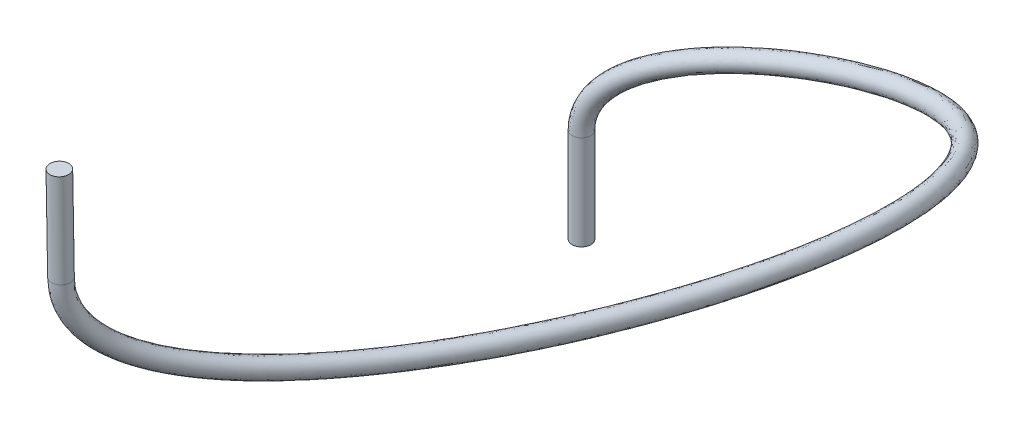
ISO-10303-21;
HEADER;
FILE_DESCRIPTION(('STEP AP214'),'2;1');
FILE_NAME('part.step','',(''),(''),'','','');
FILE_SCHEMA(('AUTOMOTIVE_DESIGN { 1 0 10303 214 1 1 1 1 }'));
ENDSEC;
DATA;
#1=APPLICATION_CONTEXT('core data for automotive mechanical design processes');
#2=APPLICATION_PROTOCOL_DEFINITION('international standard','automotive_design',2000,#1);
#3=PRODUCT_CONTEXT('',#1,'mechanical');
#4=PRODUCT('Part','Part','',(#3));
#5=PRODUCT_RELATED_PRODUCT_CATEGORY('part','',(#4));
#6=PRODUCT_DEFINITION_FORMATION('','',#4);
#7=PRODUCT_DEFINITION_CONTEXT('part definition',#1,'design');
#8=PRODUCT_DEFINITION('design','',#6,#7);
#9=PRODUCT_DEFINITION_SHAPE('','',#8);
#10=(LENGTH_UNIT() NAMED_UNIT(*) SI_UNIT(.MILLI.,.METRE.));
#11=(NAMED_UNIT(*) PLANE_ANGLE_UNIT() SI_UNIT($,.RADIAN.));
#12=(NAMED_UNIT(*) SI_UNIT($,.STERADIAN.) SOLID_ANGLE_UNIT());
#13=UNCERTAINTY_MEASURE_WITH_UNIT(LENGTH_MEASURE(1.E-05),#10,'distance_accuracy_value','');
#14=(GEOMETRIC_REPRESENTATION_CONTEXT(3) GLOBAL_UNCERTAINTY_ASSIGNED_CONTEXT((#13)) GLOBAL_UNIT_ASSIGNED_CONTEXT((#10,
#11,#12)) REPRESENTATION_CONTEXT('',''));
#15=CARTESIAN_POINT('',(0.,0.,0.));
#16=DIRECTION('',(0.,0.,1.));
#17=DIRECTION('',(1.,0.,0.));
#18=AXIS2_PLACEMENT_3D('',#15,#16,#17);
#19=CARTESIAN_POINT('',(50.8,81.5720999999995,13.3985));
#20=DIRECTION('',(0.,-1.,0.));
#21=DIRECTION('',(1.,0.,0.));
#22=AXIS2_PLACEMENT_3D('',#19,#20,#21);
#23=CYLINDRICAL_SURFACE('',#22,1.);
#24=CARTESIAN_POINT('',(50.8,81.5720999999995,13.3985));
#25=DIRECTION('',(0.,-1.,0.));
#26=DIRECTION('',(0.999139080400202,0.,0.0414861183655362));
#27=AXIS2_PLACEMENT_3D('',#24,#25,#26);
#28=CIRCLE('',#27,1.);
#29=CARTESIAN_POINT('',(51.7991390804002,81.5720999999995,13.4399861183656));
#30=VERTEX_POINT('',#29);
#31=EDGE_CURVE('E27',#30,#30,#28,.T.);
#32=ORIENTED_EDGE('',*,*,#31,.T.);
#33=EDGE_LOOP('',(#32));
#34=FACE_BOUND('',#33,.T.);
#35=CARTESIAN_POINT('',(50.8,71.5644999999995,13.3985));
#36=DIRECTION('',(0.,-1.,0.));
#37=DIRECTION('',(0.999139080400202,0.,0.0414861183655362));
#38=AXIS2_PLACEMENT_3D('',#35,#36,#37);
#39=CIRCLE('',#38,1.);
#40=CARTESIAN_POINT('',(51.7991390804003,71.5644999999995,13.4399861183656));
#41=VERTEX_POINT('',#40);
#42=EDGE_CURVE('E8',#41,#41,#39,.T.);
#43=ORIENTED_EDGE('',*,*,#42,.F.);
#44=EDGE_LOOP('',(#43));
#45=FACE_BOUND('',#44,.T.);
#46=ADVANCED_FACE('F12',(#34,#45),#23,.T.);
#47=CARTESIAN_POINT('',(69.1868432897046,114.053312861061,86.9395157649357));
#48=DIRECTION('',(0.,0.999847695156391,0.0174524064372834));
#49=DIRECTION('',(0.,-0.0174524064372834,0.999847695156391));
#50=AXIS2_PLACEMENT_3D('',#47,#48,#49);
#51=CYLINDRICAL_SURFACE('',#50,1.);
#52=CARTESIAN_POINT('',(69.1868432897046,114.053312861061,86.9395157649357));
#53=DIRECTION('',(0.,-0.999847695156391,-0.0174524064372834));
#54=DIRECTION('',(0.,0.0174524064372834,-0.999847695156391));
#55=AXIS2_PLACEMENT_3D('',#52,#53,#54);
#56=CIRCLE('',#55,1.);
#57=CARTESIAN_POINT('',(69.1868432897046,114.070765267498,85.9396680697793));
#58=VERTEX_POINT('',#57);
#59=EDGE_CURVE('E18',#58,#58,#56,.T.);
#60=ORIENTED_EDGE('',*,*,#59,.F.);
#61=EDGE_LOOP('',(#60));
#62=FACE_BOUND('',#61,.T.);
#63=CARTESIAN_POINT('',(69.1868432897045,124.059388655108,87.1141724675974));
#64=DIRECTION('',(0.,-0.999847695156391,-0.0174524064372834));
#65=DIRECTION('',(0.,0.0174524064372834,-0.999847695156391));
#66=AXIS2_PLACEMENT_3D('',#63,#64,#65);
#67=CIRCLE('',#66,1.);
#68=CARTESIAN_POINT('',(69.1868432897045,124.076841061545,86.1143247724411));
#69=VERTEX_POINT('',#68);
#70=EDGE_CURVE('E22',#69,#69,#67,.T.);
#71=ORIENTED_EDGE('',*,*,#70,.T.);
#72=EDGE_LOOP('',(#71));
#73=FACE_BOUND('',#72,.T.);
#74=ADVANCED_FACE('F47',(#62,#73),#51,.T.);
#75=CARTESIAN_POINT('',(69.1868432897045,124.059388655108,87.1141724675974));
#76=DIRECTION('',(0.,-0.999847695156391,-0.0174524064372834));
#77=DIRECTION('',(0.,0.0174524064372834,-0.999847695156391));
#78=AXIS2_PLACEMENT_3D('',#75,#76,#77);
#79=PLANE('',#78);
#80=ORIENTED_EDGE('',*,*,#70,.F.);
#81=EDGE_LOOP('',(#80));
#82=FACE_BOUND('',#81,.T.);
#83=ADVANCED_FACE('F42',(#82),#79,.F.);
#84=CARTESIAN_POINT('',(50.8,71.5644999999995,13.3985));
#85=DIRECTION('',(0.,-1.,0.));
#86=DIRECTION('',(0.999139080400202,0.,0.0414861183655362));
#87=AXIS2_PLACEMENT_3D('',#84,#85,#86);
#88=PLANE('',#87);
#89=ORIENTED_EDGE('',*,*,#42,.T.);
#90=EDGE_LOOP('',(#89));
#91=FACE_BOUND('',#90,.T.);
#92=ADVANCED_FACE('F36',(#91),#88,.T.);
#93=CARTESIAN_POINT('',(69.1868432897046,114.070765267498,85.9396680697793));
#94=CARTESIAN_POINT('',(69.1868432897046,113.347372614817,85.9270412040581));
#95=CARTESIAN_POINT('',(69.2573949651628,112.241262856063,85.7618247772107));
#96=CARTESIAN_POINT('',(69.5957390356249,110.543299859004,85.1079696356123));
#97=CARTESIAN_POINT('',(70.1464027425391,109.028475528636,84.0522906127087));
#98=CARTESIAN_POINT('',(70.9028146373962,107.619235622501,82.595716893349));
#99=CARTESIAN_POINT('',(71.844139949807,106.342488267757,80.7590084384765));
#100=CARTESIAN_POINT('',(73.6767576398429,104.426375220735,77.1146565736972));
#101=CARTESIAN_POINT('',(76.8667721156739,102.39161965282,70.5426996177));
#102=CARTESIAN_POINT('',(83.180752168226,99.6609779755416,55.8675100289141));
#103=CARTESIAN_POINT('',(89.1201077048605,99.6875624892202,40.7116685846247));
#104=CARTESIAN_POINT('',(91.3753659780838,99.3619545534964,28.6882032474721));
#105=CARTESIAN_POINT('',(91.8805909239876,99.273408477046,23.0307984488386));
#106=CARTESIAN_POINT('',(91.6037548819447,99.1597367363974,18.8071753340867));
#107=CARTESIAN_POINT('',(90.8636620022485,99.017680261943,15.8090687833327));
#108=CARTESIAN_POINT('',(89.967326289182,98.8659241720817,13.7444897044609));
#109=CARTESIAN_POINT('',(88.7558676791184,98.6683045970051,12.0238786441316));
#110=CARTESIAN_POINT('',(87.272175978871,98.4228733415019,10.7090985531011));
#111=CARTESIAN_POINT('',(85.9959143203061,98.2122064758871,10.0057654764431));
#112=CARTESIAN_POINT('',(84.5646168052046,97.9569484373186,9.42916940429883));
#113=CARTESIAN_POINT('',(82.8498594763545,97.626154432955,8.96488407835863));
#114=CARTESIAN_POINT('',(80.0623995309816,97.0460285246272,8.65095072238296));
#115=CARTESIAN_POINT('',(75.3030303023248,95.9315607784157,8.63913971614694));
#116=CARTESIAN_POINT('',(68.216966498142,93.7244622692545,9.56093860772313));
#117=CARTESIAN_POINT('',(61.0966347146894,90.798683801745,10.8940373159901));
#118=CARTESIAN_POINT('',(56.4859341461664,88.2372814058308,12.0554887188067));
#119=CARTESIAN_POINT('',(54.2665600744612,86.4877143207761,12.6914047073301));
#120=CARTESIAN_POINT('',(52.9929282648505,85.017891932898,13.0781722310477));
#121=CARTESIAN_POINT('',(52.3062128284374,83.9085304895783,13.2913741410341));
#122=CARTESIAN_POINT('',(51.8933480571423,82.7241675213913,13.4225481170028));
#123=CARTESIAN_POINT('',(51.7991390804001,82.054870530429,13.4399861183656));
#124=CARTESIAN_POINT('',(51.7991390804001,81.5721,13.4399861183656));
#125=CARTESIAN_POINT('',(71.1868432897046,114.070765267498,85.9396680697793));
#126=CARTESIAN_POINT('',(71.1868432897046,113.113326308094,85.9229559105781));
#127=CARTESIAN_POINT('',(71.2455924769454,112.659594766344,85.7652007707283));
#128=CARTESIAN_POINT('',(71.5303276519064,111.0247639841,85.1876225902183));
#129=CARTESIAN_POINT('',(72.010837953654,109.749827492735,84.2317788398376));
#130=CARTESIAN_POINT('',(72.696973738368,108.46208680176,82.8661487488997));
#131=CARTESIAN_POINT('',(73.574242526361,107.291482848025,81.0985897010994));
#132=CARTESIAN_POINT('',(75.2967978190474,105.525226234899,77.5266318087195));
#133=CARTESIAN_POINT('',(78.4010912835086,103.682822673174,70.9832664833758));
#134=CARTESIAN_POINT('',(83.6698607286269,101.750021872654,55.9105114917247));
#135=CARTESIAN_POINT('',(90.3251735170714,101.291761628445,41.0584964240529));
#136=CARTESIAN_POINT('',(92.0969035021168,101.232528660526,28.7829123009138));
#137=CARTESIAN_POINT('',(92.4989961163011,101.17584740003,23.0286320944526));
#138=CARTESIAN_POINT('',(92.140642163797,101.084845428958,18.6865967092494));
#139=CARTESIAN_POINT('',(91.3261144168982,100.948757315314,15.5587858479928));
#140=CARTESIAN_POINT('',(90.3486423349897,100.795895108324,13.372217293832));
#141=CARTESIAN_POINT('',(89.0209872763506,100.588890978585,11.521817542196));
#142=CARTESIAN_POINT('',(87.3916748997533,100.328654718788,10.1055436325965));
#143=CARTESIAN_POINT('',(86.0037396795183,100.101682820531,9.3480152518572));
#144=CARTESIAN_POINT('',(84.4595234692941,99.8403586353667,8.76173885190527));
#145=CARTESIAN_POINT('',(82.6234854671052,99.5180444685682,8.34781207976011));
#146=CARTESIAN_POINT('',(79.7203380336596,98.9578789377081,8.16492976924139));
#147=CARTESIAN_POINT('',(74.8312459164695,97.8931346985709,8.47759982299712));
#148=CARTESIAN_POINT('',(67.773226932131,95.6593302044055,10.420165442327));
#149=CARTESIAN_POINT('',(61.0075566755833,91.9954084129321,12.5385683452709));
#150=CARTESIAN_POINT('',(56.4941270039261,89.0845078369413,13.869330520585));
#151=CARTESIAN_POINT('',(54.2718536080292,87.163618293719,14.5780775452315));
#152=CARTESIAN_POINT('',(52.9599535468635,85.5276653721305,15.0119574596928));
#153=CARTESIAN_POINT('',(52.2379077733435,84.3016734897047,15.2575281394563));
#154=CARTESIAN_POINT('',(51.791803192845,82.8434399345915,15.4134058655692));
#155=CARTESIAN_POINT('',(51.716166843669,82.285350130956,15.4382642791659));
#156=CARTESIAN_POINT('',(51.716166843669,81.5721,15.4382642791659));
#157=CARTESIAN_POINT('',(71.1868432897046,114.035860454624,87.9393634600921));
#158=CARTESIAN_POINT('',(71.1868432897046,113.078421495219,87.9226513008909));
#159=CARTESIAN_POINT('',(71.2908601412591,112.083626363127,87.7189617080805));
#160=CARTESIAN_POINT('',(71.6877992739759,110.114832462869,86.9701854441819));
#161=CARTESIAN_POINT('',(72.3154323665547,108.519200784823,85.7956619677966));
#162=CARTESIAN_POINT('',(73.1469752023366,107.058560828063,84.2252385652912));
#163=CARTESIAN_POINT('',(74.1598273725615,105.788480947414,82.2884795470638));
#164=CARTESIAN_POINT('',(76.0979134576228,103.962575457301,78.498448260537));
#165=CARTESIAN_POINT('',(79.4706756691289,102.12838592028,71.797803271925));
#166=CARTESIAN_POINT('',(85.6061483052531,101.273745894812,56.7085998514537));
#167=CARTESIAN_POINT('',(91.8511589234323,100.040898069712,41.593934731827));
#168=CARTESIAN_POINT('',(93.9478134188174,100.506678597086,29.0750590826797));
#169=CARTESIAN_POINT('',(94.4068136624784,100.560637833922,23.0938137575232));
#170=CARTESIAN_POINT('',(94.0628693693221,100.542951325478,18.4550456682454));
#171=CARTESIAN_POINT('',(93.1806966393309,100.436894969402,14.9834357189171));
#172=CARTESIAN_POINT('',(92.0756009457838,100.291437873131,12.4705907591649));
#173=CARTESIAN_POINT('',(90.5154668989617,100.069621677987,10.2722911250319));
#174=CARTESIAN_POINT('',(88.5683248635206,99.7802356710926,8.56389775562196));
#175=CARTESIAN_POINT('',(86.9205790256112,99.5151708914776,7.66609250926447));
#176=CARTESIAN_POINT('',(85.1340563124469,99.2473201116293,6.96854639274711));
#177=CARTESIAN_POINT('',(83.0677151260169,98.9640803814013,6.47001037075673));
#178=CARTESIAN_POINT('',(79.9188939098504,98.502436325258,6.22279445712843));
#179=CARTESIAN_POINT('',(74.711752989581,97.7044939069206,6.46083822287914));
#180=CARTESIAN_POINT('',(67.2080250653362,96.4007386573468,8.46520497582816));
#181=CARTESIAN_POINT('',(60.1272408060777,93.4651383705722,11.4282322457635));
#182=CARTESIAN_POINT('',(55.3530722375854,90.5860508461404,13.1780097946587));
#183=CARTESIAN_POINT('',(52.8908333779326,88.5441397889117,14.0987693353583));
#184=CARTESIAN_POINT('',(51.3397542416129,86.673858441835,14.6870493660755));
#185=CARTESIAN_POINT('',(50.4315598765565,85.1434805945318,15.0422904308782));
#186=CARTESIAN_POINT('',(49.8338463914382,83.3844627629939,15.2817102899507));
#187=CARTESIAN_POINT('',(49.7178886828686,82.285350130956,15.3552920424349));
#188=CARTESIAN_POINT('',(49.7178886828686,81.5721,15.3552920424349));
#189=CARTESIAN_POINT('',(69.1868432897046,114.035860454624,87.9393634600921));
#190=CARTESIAN_POINT('',(69.1868432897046,113.195444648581,87.9246939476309));
#191=CARTESIAN_POINT('',(69.3026626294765,111.719605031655,87.7165337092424));
#192=CARTESIAN_POINT('',(69.7532106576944,109.618816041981,86.8902784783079));
#193=CARTESIAN_POINT('',(70.4509971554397,107.801747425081,85.6162417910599));
#194=CARTESIAN_POINT('',(71.3528161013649,106.214667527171,83.9547885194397));
#195=CARTESIAN_POINT('',(72.4297247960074,104.839756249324,81.9489029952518));
#196=CARTESIAN_POINT('',(74.4778732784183,102.863482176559,78.0864687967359));
#197=CARTESIAN_POINT('',(77.9363565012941,100.837271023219,71.3572379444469));
#198=CARTESIAN_POINT('',(85.1170397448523,99.1846432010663,56.665597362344));
#199=CARTESIAN_POINT('',(90.6460931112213,98.4367037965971,41.2471069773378));
#200=CARTESIAN_POINT('',(93.2262758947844,98.6361038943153,28.9803500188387));
#201=CARTESIAN_POINT('',(93.7884084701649,98.6581990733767,23.0959801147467));
#202=CARTESIAN_POINT('',(93.5259820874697,98.6178426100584,18.5756242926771));
#203=CARTESIAN_POINT('',(92.7182442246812,98.5058179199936,15.2337186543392));
#204=CARTESIAN_POINT('',(91.694284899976,98.3614669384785,12.8428631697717));
#205=CARTESIAN_POINT('',(90.2503473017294,98.1490352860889,10.7743522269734));
#206=CARTESIAN_POINT('',(88.4488259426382,97.8744543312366,9.16745267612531));
#207=CARTESIAN_POINT('',(86.912753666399,97.6256944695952,8.32384273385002));
#208=CARTESIAN_POINT('',(85.2391496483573,97.3639099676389,7.63597694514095));
#209=CARTESIAN_POINT('',(83.2940891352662,97.0721908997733,7.08708236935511));
#210=CARTESIAN_POINT('',(80.2609554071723,96.5905838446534,6.70881541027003));
#211=CARTESIAN_POINT('',(75.1835373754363,95.7429331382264,6.622378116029));
#212=CARTESIAN_POINT('',(67.6517646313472,94.4657253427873,7.60597814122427));
#213=CARTESIAN_POINT('',(60.2163188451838,92.2688284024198,9.7837012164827));
#214=CARTESIAN_POINT('',(55.3448793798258,89.7381071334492,11.3641679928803));
#215=CARTESIAN_POINT('',(52.8855398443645,87.8703974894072,12.2120964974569));
#216=CARTESIAN_POINT('',(51.3727289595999,86.1603374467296,12.7532641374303));
#217=CARTESIAN_POINT('',(50.4998649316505,84.7646434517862,13.0761364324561));
#218=CARTESIAN_POINT('',(49.9353912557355,83.2117144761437,13.2908525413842));
#219=CARTESIAN_POINT('',(49.8008609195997,82.1701103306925,13.3570138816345));
#220=CARTESIAN_POINT('',(49.8008609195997,81.5721,13.3570138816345));
#221=CARTESIAN_POINT('',(67.1868432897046,114.035860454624,87.9393634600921));
#222=CARTESIAN_POINT('',(67.1868432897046,113.312467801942,87.9267365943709));
#223=CARTESIAN_POINT('',(67.3144651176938,111.355583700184,87.7141057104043));
#224=CARTESIAN_POINT('',(67.8186220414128,109.122799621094,86.810371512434));
#225=CARTESIAN_POINT('',(68.5865619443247,107.084294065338,85.4368216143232));
#226=CARTESIAN_POINT('',(69.5586570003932,105.370774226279,83.6843384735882));
#227=CARTESIAN_POINT('',(70.6996222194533,103.891031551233,81.6093264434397));
#228=CARTESIAN_POINT('',(72.8578330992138,101.764388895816,77.6744893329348));
#229=CARTESIAN_POINT('',(76.4020373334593,99.5461561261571,70.9166726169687));
#230=CARTESIAN_POINT('',(84.6279311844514,97.0955405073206,56.6225948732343));
#231=CARTESIAN_POINT('',(89.4410272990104,96.832509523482,40.9002792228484));
#232=CARTESIAN_POINT('',(92.5047383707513,96.7655291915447,28.8856409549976));
#233=CARTESIAN_POINT('',(93.1700032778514,96.7557603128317,23.0981464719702));
#234=CARTESIAN_POINT('',(92.9890948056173,96.6927338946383,18.6962029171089));
#235=CARTESIAN_POINT('',(92.2557918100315,96.5747408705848,15.4840015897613));
#236=CARTESIAN_POINT('',(91.3129688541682,96.4314960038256,13.2151355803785));
#237=CARTESIAN_POINT('',(89.9852277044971,96.2284488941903,11.276413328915));
#238=CARTESIAN_POINT('',(88.3293270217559,95.9686729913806,9.77100759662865));
#239=CARTESIAN_POINT('',(86.9049283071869,95.7362180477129,8.98159295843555));
#240=CARTESIAN_POINT('',(85.3442429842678,95.4804998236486,8.30340749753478));
#241=CARTESIAN_POINT('',(83.5204631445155,95.1803014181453,7.70415436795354));
#242=CARTESIAN_POINT('',(80.6030169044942,94.6787313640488,7.19483636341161));
#243=CARTESIAN_POINT('',(75.6553217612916,93.7813723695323,6.78391800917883));
#244=CARTESIAN_POINT('',(68.0955041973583,92.5307120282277,6.74675130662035));
#245=CARTESIAN_POINT('',(60.3053968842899,91.0725184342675,8.13917018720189));
#246=CARTESIAN_POINT('',(55.3366865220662,88.8901634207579,9.55032619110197));
#247=CARTESIAN_POINT('',(52.8802463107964,87.1966551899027,10.3254236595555));
#248=CARTESIAN_POINT('',(51.4057036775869,85.6468164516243,10.8194789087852));
#249=CARTESIAN_POINT('',(50.5681699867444,84.3858063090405,11.1099824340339));
#250=CARTESIAN_POINT('',(50.0369361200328,83.0389661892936,11.2999947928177));
#251=CARTESIAN_POINT('',(49.8838331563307,82.054870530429,11.3587357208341));
#252=CARTESIAN_POINT('',(49.8838331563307,81.5720999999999,11.3587357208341));
#253=CARTESIAN_POINT('',(67.1868432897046,114.070765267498,85.9396680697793));
#254=CARTESIAN_POINT('',(67.1868432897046,113.58141892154,85.9311264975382));
#255=CARTESIAN_POINT('',(67.2691974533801,111.822930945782,85.7584487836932));
#256=CARTESIAN_POINT('',(67.6611504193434,110.061835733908,85.0283166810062));
#257=CARTESIAN_POINT('',(68.281967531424,108.307123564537,83.8728023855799));
#258=CARTESIAN_POINT('',(69.1086555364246,106.776384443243,82.3252850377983));
#259=CARTESIAN_POINT('',(70.1140373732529,105.393493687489,80.4194271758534));
#260=CARTESIAN_POINT('',(72.0567174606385,103.327524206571,76.7026813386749));
#261=CARTESIAN_POINT('',(75.3324529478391,101.100416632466,70.102132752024));
#262=CARTESIAN_POINT('',(82.6916436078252,97.5719340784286,55.8245085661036));
#263=CARTESIAN_POINT('',(87.9150418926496,98.0833633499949,40.3648407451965));
#264=CARTESIAN_POINT('',(90.6538284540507,97.4913804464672,28.5934941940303));
#265=CARTESIAN_POINT('',(91.2621857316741,97.3709695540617,23.0329648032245));
#266=CARTESIAN_POINT('',(91.0668676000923,97.2346280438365,18.9277539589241));
#267=CARTESIAN_POINT('',(90.4012095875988,97.086603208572,16.0593517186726));
#268=CARTESIAN_POINT('',(89.5860102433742,96.9359532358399,14.1167621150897));
#269=CARTESIAN_POINT('',(88.4907480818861,96.7477182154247,12.5259397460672));
#270=CARTESIAN_POINT('',(87.1526770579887,96.5170919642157,11.3126534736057));
#271=CARTESIAN_POINT('',(85.988088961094,96.3227301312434,10.6635157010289));
#272=CARTESIAN_POINT('',(84.6697101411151,96.0735382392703,10.0965999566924));
#273=CARTESIAN_POINT('',(83.0762334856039,95.7342643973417,9.58195607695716));
#274=CARTESIAN_POINT('',(80.4044610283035,95.1341781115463,9.13697167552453));
#275=CARTESIAN_POINT('',(75.7748146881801,93.9699868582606,8.8006796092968));
#276=CARTESIAN_POINT('',(68.6607060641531,91.7895943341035,8.70171177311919));
#277=CARTESIAN_POINT('',(61.1857127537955,89.601959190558,9.24950628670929));
#278=CARTESIAN_POINT('',(56.4777412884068,87.3900549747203,10.2416469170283));
#279=CARTESIAN_POINT('',(54.261266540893,85.8118103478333,10.8047318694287));
#280=CARTESIAN_POINT('',(53.0259029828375,84.5081184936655,11.1443870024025));
#281=CARTESIAN_POINT('',(52.3745178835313,83.515387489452,11.325220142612));
#282=CARTESIAN_POINT('',(51.9948929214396,82.604895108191,11.4316903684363));
#283=CARTESIAN_POINT('',(51.8821113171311,81.824390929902,11.4417079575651));
#284=CARTESIAN_POINT('',(51.8821113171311,81.5721,11.4417079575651));
#285=CARTESIAN_POINT('',(69.1868432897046,114.070765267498,85.9396680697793));
#286=CARTESIAN_POINT('',(69.1868432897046,113.347372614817,85.9270412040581));
#287=CARTESIAN_POINT('',(69.2573949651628,112.241262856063,85.7618247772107));
#288=CARTESIAN_POINT('',(69.5957390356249,110.543299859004,85.1079696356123));
#289=CARTESIAN_POINT('',(70.1464027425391,109.028475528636,84.0522906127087));
#290=CARTESIAN_POINT('',(70.9028146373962,107.619235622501,82.595716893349));
#291=CARTESIAN_POINT('',(71.844139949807,106.342488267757,80.7590084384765));
#292=CARTESIAN_POINT('',(73.6767576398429,104.426375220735,77.1146565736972));
#293=CARTESIAN_POINT('',(76.8667721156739,102.39161965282,70.5426996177));
#294=CARTESIAN_POINT('',(83.180752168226,99.6609779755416,55.8675100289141));
#295=CARTESIAN_POINT('',(89.1201077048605,99.6875624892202,40.7116685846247));
#296=CARTESIAN_POINT('',(91.3753659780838,99.3619545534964,28.6882032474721));
#297=CARTESIAN_POINT('',(91.8805909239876,99.273408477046,23.0307984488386));
#298=CARTESIAN_POINT('',(91.6037548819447,99.1597367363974,18.8071753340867));
#299=CARTESIAN_POINT('',(90.8636620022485,99.017680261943,15.8090687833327));
#300=CARTESIAN_POINT('',(89.967326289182,98.8659241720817,13.7444897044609));
#301=CARTESIAN_POINT('',(88.7558676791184,98.6683045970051,12.0238786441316));
#302=CARTESIAN_POINT('',(87.272175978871,98.4228733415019,10.7090985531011));
#303=CARTESIAN_POINT('',(85.9959143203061,98.2122064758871,10.0057654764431));
#304=CARTESIAN_POINT('',(84.5646168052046,97.9569484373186,9.42916940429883));
#305=CARTESIAN_POINT('',(82.8498594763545,97.626154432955,8.96488407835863));
#306=CARTESIAN_POINT('',(80.0623995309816,97.0460285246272,8.65095072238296));
#307=CARTESIAN_POINT('',(75.3030303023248,95.9315607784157,8.63913971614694));
#308=CARTESIAN_POINT('',(68.216966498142,93.7244622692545,9.56093860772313));
#309=CARTESIAN_POINT('',(61.0966347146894,90.798683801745,10.8940373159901));
#310=CARTESIAN_POINT('',(56.4859341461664,88.2372814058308,12.0554887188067));
#311=CARTESIAN_POINT('',(54.2665600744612,86.4877143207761,12.6914047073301));
#312=CARTESIAN_POINT('',(52.9929282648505,85.017891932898,13.0781722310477));
#313=CARTESIAN_POINT('',(52.3062128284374,83.9085304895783,13.2913741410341));
#314=CARTESIAN_POINT('',(51.8933480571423,82.7241675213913,13.4225481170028));
#315=CARTESIAN_POINT('',(51.7991390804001,82.054870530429,13.4399861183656));
#316=CARTESIAN_POINT('',(51.7991390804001,81.5721,13.4399861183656));
#317=(BOUNDED_SURFACE() B_SPLINE_SURFACE(3,3,((#93,#94,#95,#96,#97,#98,#99,#100,#101,#102,#103,
#104,#105,#106,#107,#108,#109,#110,#111,#112,#113,#114,#115,#116,#117,#118,#119,#120,#121,#122,
#123,#124),(#125,#126,#127,#128,#129,#130,#131,#132,#133,#134,#135,#136,#137,#138,#139,#140,
#141,#142,#143,#144,#145,#146,#147,#148,#149,#150,#151,#152,#153,#154,#155,#156),(#157,#158,
#159,#160,#161,#162,#163,#164,#165,#166,#167,#168,#169,#170,#171,#172,#173,#174,#175,#176,#177,
#178,#179,#180,#181,#182,#183,#184,#185,#186,#187,#188),(#189,#190,#191,#192,#193,#194,#195,
#196,#197,#198,#199,#200,#201,#202,#203,#204,#205,#206,#207,#208,#209,#210,#211,#212,#213,#214,
#215,#216,#217,#218,#219,#220),(#221,#222,#223,#224,#225,#226,#227,#228,#229,#230,#231,#232,
#233,#234,#235,#236,#237,#238,#239,#240,#241,#242,#243,#244,#245,#246,#247,#248,#249,#250,#251,
#252),(#253,#254,#255,#256,#257,#258,#259,#260,#261,#262,#263,#264,#265,#266,#267,#268,#269,
#270,#271,#272,#273,#274,#275,#276,#277,#278,#279,#280,#281,#282,#283,#284),(#285,#286,#287,
#288,#289,#290,#291,#292,#293,#294,#295,#296,#297,#298,#299,#300,#301,#302,#303,#304,#305,#306,
#307,#308,#309,#310,#311,#312,#313,#314,#315,#316)),.UNSPECIFIED.,.T.,.F.,
.F.) B_SPLINE_SURFACE_WITH_KNOTS((4,3,4),(4,1,1,1,1,1,1,1,1,1,1,1,1,1,1,1,1,1,1,1,1,1,1,1,1,1,1,
1,1,4),(0.,0.5,1.),(0.,0.0234374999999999,0.0468750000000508,0.0703125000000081,
0.0937500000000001,0.1171875,0.140625,0.2109375,0.281250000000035,0.43875,0.479999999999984,
0.521249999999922,0.5625,0.5859375,0.609375,0.632812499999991,0.65625,0.676518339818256,
0.679687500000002,0.703125,0.726562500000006,0.75,0.8125,0.875,0.90625,0.9375,0.953125,0.96875,
0.984374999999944,1.),
.UNSPECIFIED.) GEOMETRIC_REPRESENTATION_ITEM() RATIONAL_B_SPLINE_SURFACE(((1.,1.,1.,1.,1.,1.,1.,
1.,1.,1.,1.,1.,1.,1.,1.,1.,1.,1.,1.,1.,1.,1.,1.,1.,1.,1.,1.,1.,1.,1.,1.,1.),(0.333333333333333,
0.333333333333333,0.333333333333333,0.333333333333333,0.333333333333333,0.333333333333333,
0.333333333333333,0.333333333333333,0.333333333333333,0.333333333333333,0.333333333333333,
0.333333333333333,0.333333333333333,0.333333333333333,0.333333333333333,0.333333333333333,
0.333333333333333,0.333333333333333,0.333333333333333,0.333333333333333,0.333333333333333,
0.333333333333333,0.333333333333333,0.333333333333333,0.333333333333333,0.333333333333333,
0.333333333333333,0.333333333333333,0.333333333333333,0.333333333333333,0.333333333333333,
0.333333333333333),(0.333333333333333,0.333333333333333,0.333333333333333,0.333333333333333,
0.333333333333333,0.333333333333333,0.333333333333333,0.333333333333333,0.333333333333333,
0.333333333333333,0.333333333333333,0.333333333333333,0.333333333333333,0.333333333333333,
0.333333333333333,0.333333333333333,0.333333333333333,0.333333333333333,0.333333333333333,
0.333333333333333,0.333333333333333,0.333333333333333,0.333333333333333,0.333333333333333,
0.333333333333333,0.333333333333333,0.333333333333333,0.333333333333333,0.333333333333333,
0.333333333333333,0.333333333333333,0.333333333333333),(1.,1.,1.,1.,1.,1.,1.,1.,1.,1.,1.,1.,1.,
1.,1.,1.,1.,1.,1.,1.,1.,1.,1.,1.,1.,1.,1.,1.,1.,1.,1.,1.),(0.333333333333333,0.333333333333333,
0.333333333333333,0.333333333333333,0.333333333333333,0.333333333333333,0.333333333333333,
0.333333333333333,0.333333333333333,0.333333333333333,0.333333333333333,0.333333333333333,
0.333333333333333,0.333333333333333,0.333333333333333,0.333333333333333,0.333333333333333,
0.333333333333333,0.333333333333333,0.333333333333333,0.333333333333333,0.333333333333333,
0.333333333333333,0.333333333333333,0.333333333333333,0.333333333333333,0.333333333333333,
0.333333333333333,0.333333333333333,0.333333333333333,0.333333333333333,0.333333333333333),
(0.333333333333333,0.333333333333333,0.333333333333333,0.333333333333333,0.333333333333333,
0.333333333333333,0.333333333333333,0.333333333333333,0.333333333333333,0.333333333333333,
0.333333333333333,0.333333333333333,0.333333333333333,0.333333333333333,0.333333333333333,
0.333333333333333,0.333333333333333,0.333333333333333,0.333333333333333,0.333333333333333,
0.333333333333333,0.333333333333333,0.333333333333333,0.333333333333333,0.333333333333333,
0.333333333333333,0.333333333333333,0.333333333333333,0.333333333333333,0.333333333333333,
0.333333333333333,0.333333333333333),(1.,1.,1.,1.,1.,1.,1.,1.,1.,1.,1.,1.,1.,1.,1.,1.,1.,1.,1.,
1.,1.,1.,1.,1.,1.,1.,1.,1.,1.,1.,1.,1.))) REPRESENTATION_ITEM('') SURFACE());
#318=ORIENTED_EDGE('',*,*,#59,.T.);
#319=EDGE_LOOP('',(#318));
#320=FACE_BOUND('',#319,.T.);
#321=ORIENTED_EDGE('',*,*,#31,.F.);
#322=EDGE_LOOP('',(#321));
#323=FACE_BOUND('',#322,.T.);
#324=ADVANCED_FACE('F34',(#320,#323),#317,.T.);
#325=CLOSED_SHELL('',(#46,#74,#83,#92,#324));
#326=MANIFOLD_SOLID_BREP('B1',#325);
#327=ADVANCED_BREP_SHAPE_REPRESENTATION('',(#18,#326),#14);
#328=SHAPE_DEFINITION_REPRESENTATION(#9,#327);
ENDSEC;
END-ISO-10303-21;
